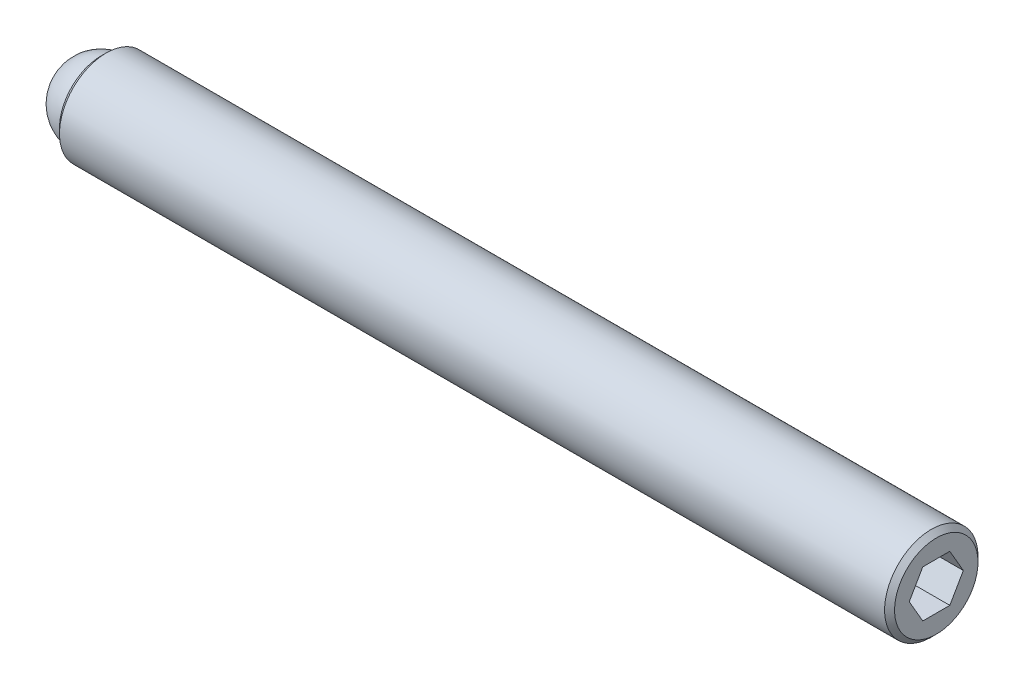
ISO-10303-21;
HEADER;
FILE_DESCRIPTION(('STEP AP214'),'2;1');
FILE_NAME('part.step','',(''),(''),'','','');
FILE_SCHEMA(('AUTOMOTIVE_DESIGN { 1 0 10303 214 1 1 1 1 }'));
ENDSEC;
DATA;
#1=APPLICATION_CONTEXT('core data for automotive mechanical design processes');
#2=APPLICATION_PROTOCOL_DEFINITION('international standard','automotive_design',2000,#1);
#3=PRODUCT_CONTEXT('',#1,'mechanical');
#4=PRODUCT('Part','Part','',(#3));
#5=PRODUCT_RELATED_PRODUCT_CATEGORY('part','',(#4));
#6=PRODUCT_DEFINITION_FORMATION('','',#4);
#7=PRODUCT_DEFINITION_CONTEXT('part definition',#1,'design');
#8=PRODUCT_DEFINITION('design','',#6,#7);
#9=PRODUCT_DEFINITION_SHAPE('','',#8);
#10=(LENGTH_UNIT() NAMED_UNIT(*) SI_UNIT(.MILLI.,.METRE.));
#11=(NAMED_UNIT(*) PLANE_ANGLE_UNIT() SI_UNIT($,.RADIAN.));
#12=(NAMED_UNIT(*) SI_UNIT($,.STERADIAN.) SOLID_ANGLE_UNIT());
#13=UNCERTAINTY_MEASURE_WITH_UNIT(LENGTH_MEASURE(1.E-05),#10,'distance_accuracy_value','');
#14=(GEOMETRIC_REPRESENTATION_CONTEXT(3) GLOBAL_UNCERTAINTY_ASSIGNED_CONTEXT((#13)) GLOBAL_UNIT_ASSIGNED_CONTEXT((#10,
#11,#12)) REPRESENTATION_CONTEXT('',''));
#15=CARTESIAN_POINT('',(0.,0.,0.));
#16=DIRECTION('',(0.,0.,1.));
#17=DIRECTION('',(1.,0.,0.));
#18=AXIS2_PLACEMENT_3D('',#15,#16,#17);
#19=CARTESIAN_POINT('',(0.,0.,0.));
#20=DIRECTION('',(0.,-1.,0.));
#21=DIRECTION('',(0.,0.,1.));
#22=AXIS2_PLACEMENT_3D('',#19,#20,#21);
#23=SPHERICAL_SURFACE('',#22,1.984375);
#24=CARTESIAN_POINT('',(0.,-1.984375,0.));
#25=VERTEX_POINT('',#24);
#26=VERTEX_LOOP('',#25);
#27=FACE_BOUND('',#26,.T.);
#28=ADVANCED_FACE('F41',(#27),#23,.T.);
#29=CLOSED_SHELL('',(#28));
#30=MANIFOLD_SOLID_BREP('B2',#29);
#31=CARTESIAN_POINT('',(42.465625,0.,0.));
#32=DIRECTION('',(-1.,0.,0.));
#33=DIRECTION('',(0.,0.,1.));
#34=AXIS2_PLACEMENT_3D('',#31,#32,#33);
#35=CYLINDRICAL_SURFACE('',#34,2.3749);
#36=CARTESIAN_POINT('',(42.211625,0.,0.));
#37=DIRECTION('',(1.,0.,0.));
#38=DIRECTION('',(0.,0.,-1.));
#39=AXIS2_PLACEMENT_3D('',#36,#37,#38);
#40=CIRCLE('',#39,2.3749);
#41=CARTESIAN_POINT('',(42.211625,0.,-2.3749));
#42=VERTEX_POINT('',#41);
#43=EDGE_CURVE('E39',#42,#42,#40,.F.);
#44=ORIENTED_EDGE('',*,*,#43,.T.);
#45=EDGE_LOOP('',(#44));
#46=FACE_BOUND('',#45,.T.);
#47=CARTESIAN_POINT('',(0.254000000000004,0.,0.));
#48=DIRECTION('',(1.,0.,0.));
#49=DIRECTION('',(0.,0.,-1.));
#50=AXIS2_PLACEMENT_3D('',#47,#48,#49);
#51=CIRCLE('',#50,2.3749);
#52=CARTESIAN_POINT('',(0.254000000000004,0.,-2.3749));
#53=VERTEX_POINT('',#52);
#54=EDGE_CURVE('E157',#53,#53,#51,.T.);
#55=ORIENTED_EDGE('',*,*,#54,.T.);
#56=EDGE_LOOP('',(#55));
#57=FACE_BOUND('',#56,.T.);
#58=ADVANCED_FACE('F54',(#46,#57),#35,.T.);
#59=CARTESIAN_POINT('',(42.465625,0.,0.));
#60=DIRECTION('',(1.,0.,0.));
#61=DIRECTION('',(0.,0.,-1.));
#62=AXIS2_PLACEMENT_3D('',#59,#60,#61);
#63=PLANE('',#62);
#64=DIRECTION('',(0.,0.866025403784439,-0.5));
#65=VECTOR('',#64,1.);
#66=CARTESIAN_POINT('',(42.465625,-1.190625,-0.687407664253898));
#67=LINE('',#66,#65);
#68=CARTESIAN_POINT('',(42.465625,-1.190625,-0.687407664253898));
#69=VERTEX_POINT('',#68);
#70=CARTESIAN_POINT('',(42.465625,0.,-1.3748153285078));
#71=VERTEX_POINT('',#70);
#72=EDGE_CURVE('E69',#69,#71,#67,.T.);
#73=ORIENTED_EDGE('',*,*,#72,.F.);
#74=DIRECTION('',(0.,0.,-1.));
#75=VECTOR('',#74,1.);
#76=CARTESIAN_POINT('',(42.465625,-1.190625,0.687407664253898));
#77=LINE('',#76,#75);
#78=CARTESIAN_POINT('',(42.465625,-1.190625,0.687407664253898));
#79=VERTEX_POINT('',#78);
#80=EDGE_CURVE('E153',#79,#69,#77,.T.);
#81=ORIENTED_EDGE('',*,*,#80,.F.);
#82=DIRECTION('',(0.,-0.866025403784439,-0.5));
#83=VECTOR('',#82,1.);
#84=CARTESIAN_POINT('',(42.465625,0.,1.3748153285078));
#85=LINE('',#84,#83);
#86=CARTESIAN_POINT('',(42.465625,0.,1.3748153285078));
#87=VERTEX_POINT('',#86);
#88=EDGE_CURVE('E151',#87,#79,#85,.T.);
#89=ORIENTED_EDGE('',*,*,#88,.F.);
#90=DIRECTION('',(0.,-0.866025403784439,0.5));
#91=VECTOR('',#90,1.);
#92=CARTESIAN_POINT('',(42.465625,1.190625,0.687407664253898));
#93=LINE('',#92,#91);
#94=CARTESIAN_POINT('',(42.465625,1.190625,0.687407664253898));
#95=VERTEX_POINT('',#94);
#96=EDGE_CURVE('E117',#95,#87,#93,.T.);
#97=ORIENTED_EDGE('',*,*,#96,.F.);
#98=DIRECTION('',(0.,0.,1.));
#99=VECTOR('',#98,1.);
#100=CARTESIAN_POINT('',(42.465625,1.190625,-0.687407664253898));
#101=LINE('',#100,#99);
#102=CARTESIAN_POINT('',(42.465625,1.190625,-0.687407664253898));
#103=VERTEX_POINT('',#102);
#104=EDGE_CURVE('E147',#103,#95,#101,.T.);
#105=ORIENTED_EDGE('',*,*,#104,.F.);
#106=DIRECTION('',(0.,0.866025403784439,0.5));
#107=VECTOR('',#106,1.);
#108=CARTESIAN_POINT('',(42.465625,0.,-1.3748153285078));
#109=LINE('',#108,#107);
#110=EDGE_CURVE('E143',#71,#103,#109,.T.);
#111=ORIENTED_EDGE('',*,*,#110,.F.);
#112=EDGE_LOOP('',(#73,#81,#89,#97,#105,#111));
#113=FACE_BOUND('',#112,.T.);
#114=CARTESIAN_POINT('',(42.465625,0.,0.));
#115=DIRECTION('',(1.,0.,0.));
#116=DIRECTION('',(0.,0.,-1.));
#117=AXIS2_PLACEMENT_3D('',#114,#115,#116);
#118=CIRCLE('',#117,2.1209);
#119=CARTESIAN_POINT('',(42.465625,0.,-2.1209));
#120=VERTEX_POINT('',#119);
#121=EDGE_CURVE('E62',#120,#120,#118,.T.);
#122=ORIENTED_EDGE('',*,*,#121,.T.);
#123=EDGE_LOOP('',(#122));
#124=FACE_BOUND('',#123,.T.);
#125=ADVANCED_FACE('F170',(#113,#124),#63,.T.);
#126=CARTESIAN_POINT('',(0.,0.,0.));
#127=DIRECTION('',(1.,0.,0.));
#128=DIRECTION('',(0.,0.,-1.));
#129=AXIS2_PLACEMENT_3D('',#126,#127,#128);
#130=PLANE('',#129);
#131=CARTESIAN_POINT('',(0.,0.,0.));
#132=DIRECTION('',(-1.,0.,0.));
#133=DIRECTION('',(0.,0.,1.));
#134=AXIS2_PLACEMENT_3D('',#131,#132,#133);
#135=CIRCLE('',#134,1.9812);
#136=CARTESIAN_POINT('',(0.,0.,1.9812));
#137=VERTEX_POINT('',#136);
#138=EDGE_CURVE('E225',#137,#137,#135,.T.);
#139=ORIENTED_EDGE('',*,*,#138,.F.);
#140=EDGE_LOOP('',(#139));
#141=FACE_BOUND('',#140,.T.);
#142=CARTESIAN_POINT('',(0.,0.,0.));
#143=DIRECTION('',(1.,0.,0.));
#144=DIRECTION('',(0.,0.,-1.));
#145=AXIS2_PLACEMENT_3D('',#142,#143,#144);
#146=CIRCLE('',#145,2.12089999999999);
#147=CARTESIAN_POINT('',(0.,0.,-2.12089999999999));
#148=VERTEX_POINT('',#147);
#149=EDGE_CURVE('E165',#148,#148,#146,.F.);
#150=ORIENTED_EDGE('',*,*,#149,.T.);
#151=EDGE_LOOP('',(#150));
#152=FACE_BOUND('',#151,.T.);
#153=ADVANCED_FACE('F182',(#141,#152),#130,.F.);
#154=CARTESIAN_POINT('',(0.254000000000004,0.,0.));
#155=DIRECTION('',(1.,0.,0.));
#156=DIRECTION('',(0.,0.,-1.));
#157=AXIS2_PLACEMENT_3D('',#154,#155,#156);
#158=CONICAL_SURFACE('',#157,2.3749,0.785398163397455);
#159=ORIENTED_EDGE('',*,*,#149,.F.);
#160=EDGE_LOOP('',(#159));
#161=FACE_BOUND('',#160,.T.);
#162=ORIENTED_EDGE('',*,*,#54,.F.);
#163=EDGE_LOOP('',(#162));
#164=FACE_BOUND('',#163,.T.);
#165=ADVANCED_FACE('F174',(#161,#164),#158,.T.);
#166=CARTESIAN_POINT('',(42.465625,0.,0.));
#167=DIRECTION('',(-1.,0.,0.));
#168=DIRECTION('',(0.,0.,1.));
#169=AXIS2_PLACEMENT_3D('',#166,#167,#168);
#170=CONICAL_SURFACE('',#169,2.1209,0.785398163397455);
#171=ORIENTED_EDGE('',*,*,#43,.F.);
#172=EDGE_LOOP('',(#171));
#173=FACE_BOUND('',#172,.T.);
#174=ORIENTED_EDGE('',*,*,#121,.F.);
#175=EDGE_LOOP('',(#174));
#176=FACE_BOUND('',#175,.T.);
#177=ADVANCED_FACE('F56',(#173,#176),#170,.T.);
#178=CARTESIAN_POINT('',(40.179625,-1.190625,-0.687407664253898));
#179=DIRECTION('',(0.,-0.5,-0.866025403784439));
#180=DIRECTION('',(0.,0.866025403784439,-0.5));
#181=AXIS2_PLACEMENT_3D('',#178,#179,#180);
#182=PLANE('',#181);
#183=ORIENTED_EDGE('',*,*,#72,.T.);
#184=DIRECTION('',(1.,0.,0.));
#185=VECTOR('',#184,1.);
#186=CARTESIAN_POINT('',(40.179625,0.,-1.3748153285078));
#187=LINE('',#186,#185);
#188=CARTESIAN_POINT('',(40.179625,0.,-1.3748153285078));
#189=VERTEX_POINT('',#188);
#190=EDGE_CURVE('E99',#189,#71,#187,.T.);
#191=ORIENTED_EDGE('',*,*,#190,.F.);
#192=DIRECTION('',(0.,0.866025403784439,-0.5));
#193=VECTOR('',#192,1.);
#194=CARTESIAN_POINT('',(40.179625,-1.190625,-0.687407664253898));
#195=LINE('',#194,#193);
#196=CARTESIAN_POINT('',(40.179625,-1.190625,-0.687407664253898));
#197=VERTEX_POINT('',#196);
#198=EDGE_CURVE('E155',#197,#189,#195,.T.);
#199=ORIENTED_EDGE('',*,*,#198,.F.);
#200=DIRECTION('',(1.,0.,0.));
#201=VECTOR('',#200,1.);
#202=CARTESIAN_POINT('',(40.179625,-1.190625,-0.687407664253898));
#203=LINE('',#202,#201);
#204=EDGE_CURVE('E77',#197,#69,#203,.T.);
#205=ORIENTED_EDGE('',*,*,#204,.T.);
#206=EDGE_LOOP('',(#183,#191,#199,#205));
#207=FACE_BOUND('',#206,.T.);
#208=ADVANCED_FACE('F173',(#207),#182,.F.);
#209=CARTESIAN_POINT('',(40.179625,-1.190625,0.687407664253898));
#210=DIRECTION('',(0.,-1.,0.));
#211=DIRECTION('',(0.,0.,-1.));
#212=AXIS2_PLACEMENT_3D('',#209,#210,#211);
#213=PLANE('',#212);
#214=ORIENTED_EDGE('',*,*,#80,.T.);
#215=ORIENTED_EDGE('',*,*,#204,.F.);
#216=DIRECTION('',(0.,0.,-1.));
#217=VECTOR('',#216,1.);
#218=CARTESIAN_POINT('',(40.179625,-1.190625,0.687407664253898));
#219=LINE('',#218,#217);
#220=CARTESIAN_POINT('',(40.179625,-1.190625,0.687407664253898));
#221=VERTEX_POINT('',#220);
#222=EDGE_CURVE('E129',#221,#197,#219,.T.);
#223=ORIENTED_EDGE('',*,*,#222,.F.);
#224=DIRECTION('',(1.,0.,0.));
#225=VECTOR('',#224,1.);
#226=CARTESIAN_POINT('',(40.179625,-1.190625,0.687407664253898));
#227=LINE('',#226,#225);
#228=EDGE_CURVE('E121',#221,#79,#227,.T.);
#229=ORIENTED_EDGE('',*,*,#228,.T.);
#230=EDGE_LOOP('',(#214,#215,#223,#229));
#231=FACE_BOUND('',#230,.T.);
#232=ADVANCED_FACE('F180',(#231),#213,.F.);
#233=CARTESIAN_POINT('',(40.179625,0.,1.3748153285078));
#234=DIRECTION('',(0.,-0.5,0.866025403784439));
#235=DIRECTION('',(0.,-0.866025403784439,-0.5));
#236=AXIS2_PLACEMENT_3D('',#233,#234,#235);
#237=PLANE('',#236);
#238=ORIENTED_EDGE('',*,*,#88,.T.);
#239=ORIENTED_EDGE('',*,*,#228,.F.);
#240=DIRECTION('',(0.,-0.866025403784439,-0.5));
#241=VECTOR('',#240,1.);
#242=CARTESIAN_POINT('',(40.179625,0.,1.3748153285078));
#243=LINE('',#242,#241);
#244=CARTESIAN_POINT('',(40.179625,0.,1.3748153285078));
#245=VERTEX_POINT('',#244);
#246=EDGE_CURVE('E125',#245,#221,#243,.T.);
#247=ORIENTED_EDGE('',*,*,#246,.F.);
#248=DIRECTION('',(1.,0.,0.));
#249=VECTOR('',#248,1.);
#250=CARTESIAN_POINT('',(40.179625,0.,1.3748153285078));
#251=LINE('',#250,#249);
#252=EDGE_CURVE('E110',#245,#87,#251,.T.);
#253=ORIENTED_EDGE('',*,*,#252,.T.);
#254=EDGE_LOOP('',(#238,#239,#247,#253));
#255=FACE_BOUND('',#254,.T.);
#256=ADVANCED_FACE('F126',(#255),#237,.F.);
#257=CARTESIAN_POINT('',(40.179625,1.190625,0.687407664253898));
#258=DIRECTION('',(0.,0.5,0.866025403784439));
#259=DIRECTION('',(0.,-0.866025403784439,0.5));
#260=AXIS2_PLACEMENT_3D('',#257,#258,#259);
#261=PLANE('',#260);
#262=ORIENTED_EDGE('',*,*,#96,.T.);
#263=ORIENTED_EDGE('',*,*,#252,.F.);
#264=DIRECTION('',(0.,-0.866025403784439,0.5));
#265=VECTOR('',#264,1.);
#266=CARTESIAN_POINT('',(40.179625,1.190625,0.687407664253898));
#267=LINE('',#266,#265);
#268=CARTESIAN_POINT('',(40.179625,1.190625,0.687407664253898));
#269=VERTEX_POINT('',#268);
#270=EDGE_CURVE('E114',#269,#245,#267,.T.);
#271=ORIENTED_EDGE('',*,*,#270,.F.);
#272=DIRECTION('',(1.,0.,0.));
#273=VECTOR('',#272,1.);
#274=CARTESIAN_POINT('',(40.179625,1.190625,0.687407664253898));
#275=LINE('',#274,#273);
#276=EDGE_CURVE('E122',#269,#95,#275,.T.);
#277=ORIENTED_EDGE('',*,*,#276,.T.);
#278=EDGE_LOOP('',(#262,#263,#271,#277));
#279=FACE_BOUND('',#278,.T.);
#280=ADVANCED_FACE('F112',(#279),#261,.F.);
#281=CARTESIAN_POINT('',(40.179625,1.190625,-0.687407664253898));
#282=DIRECTION('',(0.,1.,0.));
#283=DIRECTION('',(0.,0.,1.));
#284=AXIS2_PLACEMENT_3D('',#281,#282,#283);
#285=PLANE('',#284);
#286=ORIENTED_EDGE('',*,*,#104,.T.);
#287=ORIENTED_EDGE('',*,*,#276,.F.);
#288=DIRECTION('',(0.,0.,1.));
#289=VECTOR('',#288,1.);
#290=CARTESIAN_POINT('',(40.179625,1.190625,-0.687407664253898));
#291=LINE('',#290,#289);
#292=CARTESIAN_POINT('',(40.179625,1.190625,-0.687407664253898));
#293=VERTEX_POINT('',#292);
#294=EDGE_CURVE('E135',#293,#269,#291,.T.);
#295=ORIENTED_EDGE('',*,*,#294,.F.);
#296=DIRECTION('',(1.,0.,0.));
#297=VECTOR('',#296,1.);
#298=CARTESIAN_POINT('',(40.179625,1.190625,-0.687407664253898));
#299=LINE('',#298,#297);
#300=EDGE_CURVE('E160',#293,#103,#299,.T.);
#301=ORIENTED_EDGE('',*,*,#300,.T.);
#302=EDGE_LOOP('',(#286,#287,#295,#301));
#303=FACE_BOUND('',#302,.T.);
#304=ADVANCED_FACE('F201',(#303),#285,.F.);
#305=CARTESIAN_POINT('',(40.179625,0.,-1.3748153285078));
#306=DIRECTION('',(0.,0.5,-0.866025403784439));
#307=DIRECTION('',(0.,0.866025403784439,0.5));
#308=AXIS2_PLACEMENT_3D('',#305,#306,#307);
#309=PLANE('',#308);
#310=ORIENTED_EDGE('',*,*,#110,.T.);
#311=ORIENTED_EDGE('',*,*,#300,.F.);
#312=DIRECTION('',(0.,0.866025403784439,0.5));
#313=VECTOR('',#312,1.);
#314=CARTESIAN_POINT('',(40.179625,0.,-1.3748153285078));
#315=LINE('',#314,#313);
#316=EDGE_CURVE('E137',#189,#293,#315,.T.);
#317=ORIENTED_EDGE('',*,*,#316,.F.);
#318=ORIENTED_EDGE('',*,*,#190,.T.);
#319=EDGE_LOOP('',(#310,#311,#317,#318));
#320=FACE_BOUND('',#319,.T.);
#321=ADVANCED_FACE('F198',(#320),#309,.F.);
#322=CARTESIAN_POINT('',(40.179625,0.,0.));
#323=DIRECTION('',(1.,0.,0.));
#324=DIRECTION('',(0.,0.,-1.));
#325=AXIS2_PLACEMENT_3D('',#322,#323,#324);
#326=PLANE('',#325);
#327=ORIENTED_EDGE('',*,*,#198,.T.);
#328=ORIENTED_EDGE('',*,*,#316,.T.);
#329=ORIENTED_EDGE('',*,*,#294,.T.);
#330=ORIENTED_EDGE('',*,*,#270,.T.);
#331=ORIENTED_EDGE('',*,*,#246,.T.);
#332=ORIENTED_EDGE('',*,*,#222,.T.);
#333=EDGE_LOOP('',(#327,#328,#329,#330,#331,#332));
#334=FACE_BOUND('',#333,.T.);
#335=ADVANCED_FACE('F132',(#334),#326,.T.);
#336=CARTESIAN_POINT('',(1.984375,0.,0.));
#337=DIRECTION('',(-1.,0.,0.));
#338=DIRECTION('',(0.,0.,1.));
#339=AXIS2_PLACEMENT_3D('',#336,#337,#338);
#340=CYLINDRICAL_SURFACE('',#339,1.9812);
#341=CARTESIAN_POINT('',(1.984375,0.,0.));
#342=DIRECTION('',(-1.,0.,0.));
#343=DIRECTION('',(0.,0.,1.));
#344=AXIS2_PLACEMENT_3D('',#341,#342,#343);
#345=CIRCLE('',#344,1.9812);
#346=CARTESIAN_POINT('',(1.984375,0.,1.9812));
#347=VERTEX_POINT('',#346);
#348=EDGE_CURVE('E144',#347,#347,#345,.T.);
#349=ORIENTED_EDGE('',*,*,#348,.F.);
#350=EDGE_LOOP('',(#349));
#351=FACE_BOUND('',#350,.T.);
#352=ORIENTED_EDGE('',*,*,#138,.T.);
#353=EDGE_LOOP('',(#352));
#354=FACE_BOUND('',#353,.T.);
#355=ADVANCED_FACE('F214',(#351,#354),#340,.F.);
#356=CARTESIAN_POINT('',(1.984375,0.,0.));
#357=DIRECTION('',(-1.,0.,0.));
#358=DIRECTION('',(0.,0.,1.));
#359=AXIS2_PLACEMENT_3D('',#356,#357,#358);
#360=PLANE('',#359);
#361=ORIENTED_EDGE('',*,*,#348,.T.);
#362=EDGE_LOOP('',(#361));
#363=FACE_BOUND('',#362,.T.);
#364=ADVANCED_FACE('F217',(#363),#360,.T.);
#365=CLOSED_SHELL('',(#58,#125,#153,#165,#177,#208,#232,#256,#280,#304,#321,#335,#355,#364));
#366=MANIFOLD_SOLID_BREP('B6',#365);
#367=ADVANCED_BREP_SHAPE_REPRESENTATION('',(#18,#30,#366),#14);
#368=SHAPE_DEFINITION_REPRESENTATION(#9,#367);
ENDSEC;
END-ISO-10303-21;
